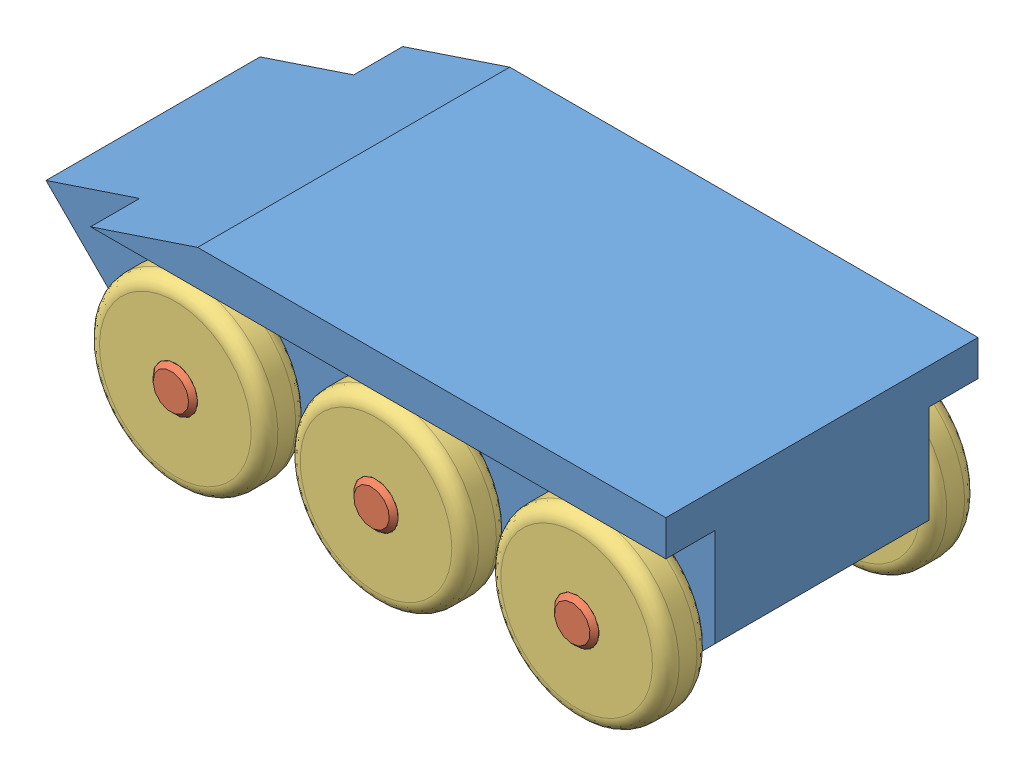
SolidWorks assembly 002.02.sldasm, configuration Default (file format 3400). Lengths in mm.
Overall size (152.26 54.94 72).
13 component instances, 3 part files, 6 mates.
Components (placement in the parent):
- 000.01-1: 000.01.sldprt [Default] at (-5.179 15.9001 -8.0694) size (150 40 70)
- 001.01-1: 001.01.sldasm [Default] at (99.5489 -23.3191 -8.0694) x (0.99271 0.120524 0) z (0 0 1) size (40 40 72)
  - 000.02-1: 000.02.sldprt [Default] at (-24.492 11.4619 -1) x (0.654083 -0.756423 0) z (0 0 1) size (10 10 72)
  - 000.03-1: 000.03.sldprt [Default] at (0 0 60) size (40 40 10)
  - 000.03-2: 000.03.sldprt [Default] at origin size (40 40 10)
- 001.01-2: 001.01.sldasm [Default] at (58.872 -18.6657 -8.0694) x (0.957029 0.289993 0) z (0 0 1) size (40 40 72)
  - 000.02-1: 000.02.sldprt [Default] at (-24.492 11.4619 -1) x (0.654083 -0.756423 0) z (0 0 1) size (10 10 72)
  - 000.03-1: 000.03.sldprt [Default] at (0 0 60) size (40 40 10)
  - 000.03-2: 000.03.sldprt [Default] at origin size (40 40 10)
- 001.01-3: 001.01.sldasm [Default] at (18.7561 18.0781 -8.0694) x (0.215343 0.976539 0) z (0 0 1) size (40 40 72)
  - 000.02-1: 000.02.sldprt [Default] at (-24.492 11.4619 -1) x (0.654083 -0.756423 0) z (0 0 1) size (10 10 72)
  - 000.03-1: 000.03.sldprt [Default] at (0 0 60) size (40 40 10)
  - 000.03-2: 000.03.sldprt [Default] at origin size (40 40 10)
Mates (geometry in assembly coordinates):
- Концентрический1: concentric aligned: cylinder of 000.01-1; cylinder of 001.01-1/000.02-1
- Концентрический2: concentric aligned: cylinder of 000.01-1; cylinder of 001.01-2/000.02-1
- Концентрический3: concentric aligned: cylinder of 000.01-1; cylinder of 001.01-3/000.02-1
- Совпадение7: coincident aligned: plane of 000.01-1 through (94.9415 -6.1237 61.9306) normal (0 0 1); plane of 001.01-1/000.03-1 through (74.9415 3.8763 61.9306) normal (0 0 1)
- Совпадение8: coincident aligned: plane of 000.01-1 through (94.9415 -6.1237 61.9306) normal (0 0 1); plane of 001.01-2/000.03-1 through (29.9415 3.8763 61.9306) normal (0 0 1)
- Совпадение9: coincident aligned: plane of 000.01-1 through (94.9415 -6.1237 61.9306) normal (0 0 1); plane of 001.01-3/000.03-1 through (-15.0585 3.8763 61.9306) normal (0 0 1)
